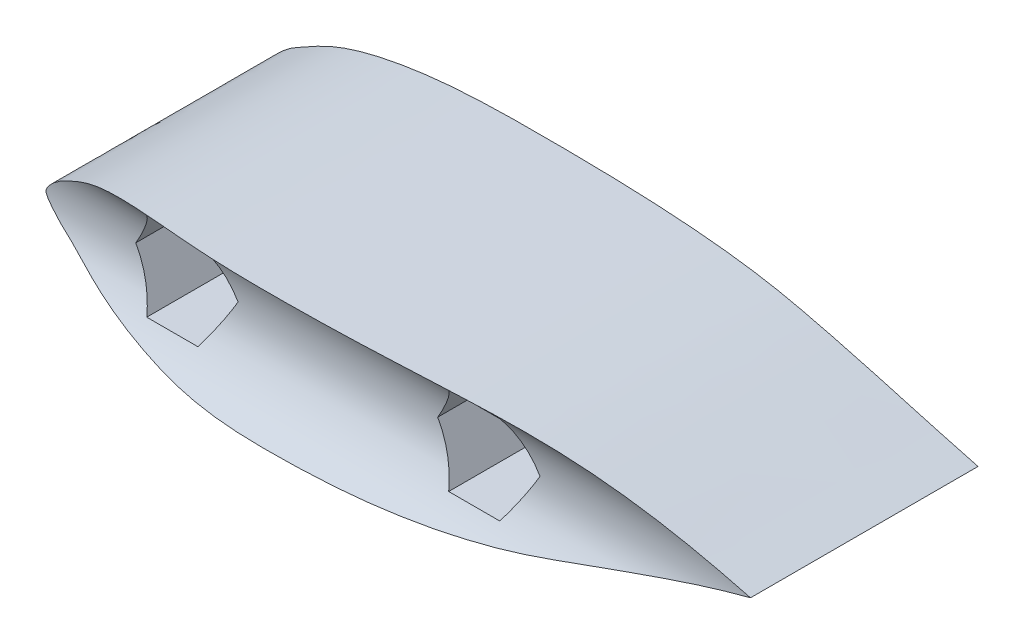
ISO-10303-21;
HEADER;
FILE_DESCRIPTION(('STEP AP214'),'2;1');
FILE_NAME('part.step','',(''),(''),'','','');
FILE_SCHEMA(('AUTOMOTIVE_DESIGN { 1 0 10303 214 1 1 1 1 }'));
ENDSEC;
DATA;
#1=APPLICATION_CONTEXT('core data for automotive mechanical design processes');
#2=APPLICATION_PROTOCOL_DEFINITION('international standard','automotive_design',2000,#1);
#3=PRODUCT_CONTEXT('',#1,'mechanical');
#4=PRODUCT('Part','Part','',(#3));
#5=PRODUCT_RELATED_PRODUCT_CATEGORY('part','',(#4));
#6=PRODUCT_DEFINITION_FORMATION('','',#4);
#7=PRODUCT_DEFINITION_CONTEXT('part definition',#1,'design');
#8=PRODUCT_DEFINITION('design','',#6,#7);
#9=PRODUCT_DEFINITION_SHAPE('','',#8);
#10=(LENGTH_UNIT() NAMED_UNIT(*) SI_UNIT(.MILLI.,.METRE.));
#11=(NAMED_UNIT(*) PLANE_ANGLE_UNIT() SI_UNIT($,.RADIAN.));
#12=(NAMED_UNIT(*) SI_UNIT($,.STERADIAN.) SOLID_ANGLE_UNIT());
#13=UNCERTAINTY_MEASURE_WITH_UNIT(LENGTH_MEASURE(1.E-05),#10,'distance_accuracy_value','');
#14=(GEOMETRIC_REPRESENTATION_CONTEXT(3) GLOBAL_UNCERTAINTY_ASSIGNED_CONTEXT((#13)) GLOBAL_UNIT_ASSIGNED_CONTEXT((#10,
#11,#12)) REPRESENTATION_CONTEXT('',''));
#15=CARTESIAN_POINT('',(0.,0.,0.));
#16=DIRECTION('',(0.,0.,1.));
#17=DIRECTION('',(1.,0.,0.));
#18=AXIS2_PLACEMENT_3D('',#15,#16,#17);
#19=CARTESIAN_POINT('',(0.,0.,15.));
#20=CARTESIAN_POINT('',(0.00772713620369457,-0.267032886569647,15.));
#21=CARTESIAN_POINT('',(0.79724552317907,-0.898720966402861,15.));
#22=CARTESIAN_POINT('',(1.40995747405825,-1.2361498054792,15.));
#23=CARTESIAN_POINT('',(3.06998534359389,-2.25920057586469,15.));
#24=CARTESIAN_POINT('',(7.56542515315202,-3.331084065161,15.));
#25=CARTESIAN_POINT('',(13.3623850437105,-3.48289192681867,15.));
#26=CARTESIAN_POINT('',(22.2900394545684,-3.26527474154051,15.));
#27=CARTESIAN_POINT('',(29.2938291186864,-1.65212955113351,15.));
#28=CARTESIAN_POINT('',(32.2346092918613,-0.717869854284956,15.));
#29=CARTESIAN_POINT('',(35.,0.,15.));
#30=B_SPLINE_CURVE_WITH_KNOTS('',3,(#19,#20,#21,#22,#23,#24,#25,#26,#27,#28,#29),.UNSPECIFIED.,
.F.,.F.,(4,1,1,1,1,1,1,1,4),(0.,0.0225244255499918,0.0346430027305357,0.121185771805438,
0.243771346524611,0.472972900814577,0.711145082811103,0.763847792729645,1.),.UNSPECIFIED.);
#31=DIRECTION('',(0.,0.,-1.));
#32=VECTOR('',#31,1.);
#33=SURFACE_OF_LINEAR_EXTRUSION('',#30,#32);
#34=CARTESIAN_POINT('',(0.,0.,11.3));
#35=CARTESIAN_POINT('',(0.000269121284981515,-0.00919435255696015,11.2999996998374));
#36=CARTESIAN_POINT('',(0.0011245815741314,-0.0183469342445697,11.300034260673));
#37=CARTESIAN_POINT('',(0.00380603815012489,-0.0364728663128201,11.3001687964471));
#38=CARTESIAN_POINT('',(0.00562799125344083,-0.0454468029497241,11.3002684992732));
#39=CARTESIAN_POINT('',(0.0121767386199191,-0.071758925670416,11.3006547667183));
#40=CARTESIAN_POINT('',(0.0180102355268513,-0.0888144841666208,11.3010288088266));
#41=CARTESIAN_POINT('',(0.0327249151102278,-0.124780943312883,11.3020539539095));
#42=CARTESIAN_POINT('',(0.0419470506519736,-0.143543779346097,11.3027401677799));
#43=CARTESIAN_POINT('',(0.06210611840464,-0.180123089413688,11.3043416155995));
#44=CARTESIAN_POINT('',(0.0730453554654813,-0.197938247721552,11.3052571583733));
#45=CARTESIAN_POINT('',(0.0963062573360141,-0.233067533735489,11.3073052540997));
#46=CARTESIAN_POINT('',(0.108648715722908,-0.250367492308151,11.3084413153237));
#47=CARTESIAN_POINT('',(0.134212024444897,-0.284265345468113,11.3108969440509));
#48=CARTESIAN_POINT('',(0.147432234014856,-0.300863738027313,11.312216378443));
#49=CARTESIAN_POINT('',(0.185370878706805,-0.346524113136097,11.31614460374));
#50=CARTESIAN_POINT('',(0.210836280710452,-0.374947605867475,11.3189412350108));
#51=CARTESIAN_POINT('',(0.26319371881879,-0.430405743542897,11.3250132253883));
#52=CARTESIAN_POINT('',(0.290086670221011,-0.457439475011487,11.3282888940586));
#53=CARTESIAN_POINT('',(0.344953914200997,-0.510444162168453,11.335281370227));
#54=CARTESIAN_POINT('',(0.372930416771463,-0.53641269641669,11.3389991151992));
#55=CARTESIAN_POINT('',(0.429653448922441,-0.587407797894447,11.3468346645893));
#56=CARTESIAN_POINT('',(0.458399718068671,-0.61243467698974,11.3509523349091));
#57=CARTESIAN_POINT('',(0.516386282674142,-0.66157388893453,11.3595413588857));
#58=CARTESIAN_POINT('',(0.545623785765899,-0.685689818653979,11.3640110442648));
#59=CARTESIAN_POINT('',(0.6046283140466,-0.733214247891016,11.3732958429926));
#60=CARTESIAN_POINT('',(0.634395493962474,-0.756622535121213,11.3781110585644));
#61=CARTESIAN_POINT('',(0.679375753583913,-0.791212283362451,11.3855675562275));
#62=CARTESIAN_POINT('',(0.694414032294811,-0.802647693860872,11.3880902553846));
#63=CARTESIAN_POINT('',(0.724607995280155,-0.825349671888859,11.3932100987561));
#64=CARTESIAN_POINT('',(0.739763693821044,-0.836616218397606,11.3958072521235));
#65=CARTESIAN_POINT('',(0.77018183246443,-0.858971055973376,11.4010695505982));
#66=CARTESIAN_POINT('',(0.785444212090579,-0.870059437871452,11.4037346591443));
#67=CARTESIAN_POINT('',(0.816105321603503,-0.892021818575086,11.409119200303));
#68=CARTESIAN_POINT('',(0.831504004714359,-0.902895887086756,11.4118386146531));
#69=CARTESIAN_POINT('',(0.866722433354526,-0.927287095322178,11.4180540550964));
#70=CARTESIAN_POINT('',(0.886602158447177,-0.940715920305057,11.4215595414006));
#71=CARTESIAN_POINT('',(0.926833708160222,-0.966856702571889,11.4285336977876));
#72=CARTESIAN_POINT('',(0.947185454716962,-0.979568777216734,11.4320023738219));
#73=CARTESIAN_POINT('',(0.978118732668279,-0.997992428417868,11.4371286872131));
#74=CARTESIAN_POINT('',(0.988501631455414,-1.00402850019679,11.438825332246));
#75=CARTESIAN_POINT('',(1.0093559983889,-1.01594956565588,11.4422078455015));
#76=CARTESIAN_POINT('',(1.01982747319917,-1.02183454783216,11.4438937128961));
#77=CARTESIAN_POINT('',(1.04076635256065,-1.03360606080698,11.4472973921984));
#78=CARTESIAN_POINT('',(1.05123375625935,-1.0394925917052,11.4490152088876));
#79=CARTESIAN_POINT('',(1.07214622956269,-1.05129270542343,11.4524908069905));
#80=CARTESIAN_POINT('',(1.08259129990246,-1.05720628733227,11.454248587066));
#81=CARTESIAN_POINT('',(1.11392231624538,-1.07498174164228,11.4595808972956));
#82=CARTESIAN_POINT('',(1.13478511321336,-1.08686765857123,11.4632113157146));
#83=CARTESIAN_POINT('',(1.17645976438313,-1.11068151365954,11.4706173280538));
#84=CARTESIAN_POINT('',(1.19727162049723,-1.12260945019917,11.4743929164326));
#85=CARTESIAN_POINT('',(1.23885072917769,-1.14647980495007,11.4820828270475));
#86=CARTESIAN_POINT('',(1.25961799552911,-1.15842221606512,11.4859970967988));
#87=CARTESIAN_POINT('',(1.30112591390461,-1.18230820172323,11.4939615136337));
#88=CARTESIAN_POINT('',(1.32186656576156,-1.19425177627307,11.4980116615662));
#89=CARTESIAN_POINT('',(1.38419690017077,-1.23013760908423,11.5103864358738));
#90=CARTESIAN_POINT('',(1.42576018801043,-1.25405731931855,11.5189103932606));
#91=CARTESIAN_POINT('',(1.50887778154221,-1.30173845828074,11.5364580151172));
#92=CARTESIAN_POINT('',(1.55043208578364,-1.32549986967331,11.5454817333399));
#93=CARTESIAN_POINT('',(1.67509563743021,-1.39639554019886,11.5732447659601));
#94=CARTESIAN_POINT('',(1.75825488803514,-1.44316992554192,11.5926858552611));
#95=CARTESIAN_POINT('',(1.92504944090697,-1.53532960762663,11.6332060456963));
#96=CARTESIAN_POINT('',(2.00868511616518,-1.58071356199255,11.6542866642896));
#97=CARTESIAN_POINT('',(2.17657458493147,-1.669702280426,11.697796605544));
#98=CARTESIAN_POINT('',(2.26082850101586,-1.71330667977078,11.7202262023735));
#99=CARTESIAN_POINT('',(2.43059195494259,-1.79865256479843,11.7662384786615));
#100=CARTESIAN_POINT('',(2.51610588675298,-1.84038221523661,11.7898269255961));
#101=CARTESIAN_POINT('',(2.68807891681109,-1.92142306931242,11.8376679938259));
#102=CARTESIAN_POINT('',(2.77453790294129,-1.96073455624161,11.8619205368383));
#103=CARTESIAN_POINT('',(2.94839424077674,-2.03650436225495,11.9105533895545));
#104=CARTESIAN_POINT('',(3.03578877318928,-2.07296943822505,11.9349332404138));
#105=CARTESIAN_POINT('',(3.21159490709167,-2.14334252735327,11.9837253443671));
#106=CARTESIAN_POINT('',(3.30000657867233,-2.17725036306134,12.0081375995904));
#107=CARTESIAN_POINT('',(3.5664160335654,-2.27545346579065,12.0812696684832));
#108=CARTESIAN_POINT('',(3.74571513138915,-2.33628277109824,12.129920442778));
#109=CARTESIAN_POINT('',(4.14484890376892,-2.46211609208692,12.2366424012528));
#110=CARTESIAN_POINT('',(4.36529101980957,-2.52531549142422,12.2945470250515));
#111=CARTESIAN_POINT('',(4.80940263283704,-2.64243502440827,12.4088168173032));
#112=CARTESIAN_POINT('',(5.03307683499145,-2.69633975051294,12.4651793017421));
#113=CARTESIAN_POINT('',(5.48279634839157,-2.79632290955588,12.5759239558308));
#114=CARTESIAN_POINT('',(5.70884305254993,-2.84239643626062,12.6303048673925));
#115=CARTESIAN_POINT('',(6.04897139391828,-2.90646282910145,12.7101029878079));
#116=CARTESIAN_POINT('',(6.16239036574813,-2.92695657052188,12.7363770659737));
#117=CARTESIAN_POINT('',(6.38962234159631,-2.96642755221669,12.7883549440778));
#118=CARTESIAN_POINT('',(6.5034353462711,-2.98540478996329,12.8140587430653));
#119=CARTESIAN_POINT('',(6.84525961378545,-3.04011871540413,12.8901257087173));
#120=CARTESIAN_POINT('',(7.07384843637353,-3.07367355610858,12.9394897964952));
#121=CARTESIAN_POINT('',(7.53259760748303,-3.13503186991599,13.0341002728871));
#122=CARTESIAN_POINT('',(7.7627575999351,-3.16283660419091,13.0793475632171));
#123=CARTESIAN_POINT('',(8.16760659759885,-3.2068080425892,13.1539860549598));
#124=CARTESIAN_POINT('',(8.34195535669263,-3.22415301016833,13.1845332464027));
#125=CARTESIAN_POINT('',(8.69151453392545,-3.25594023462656,13.2421781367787));
#126=CARTESIAN_POINT('',(8.86672507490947,-3.2703820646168,13.2692753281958));
#127=CARTESIAN_POINT('',(9.2178687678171,-3.29657905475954,13.3197099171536));
#128=CARTESIAN_POINT('',(9.39380184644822,-3.3083344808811,13.3430476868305));
#129=CARTESIAN_POINT('',(9.74623527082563,-3.32940883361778,13.3858112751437));
#130=CARTESIAN_POINT('',(9.92273543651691,-3.33872846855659,13.4052382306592));
#131=CARTESIAN_POINT('',(10.2762240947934,-3.35520565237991,13.4402022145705));
#132=CARTESIAN_POINT('',(10.4532125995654,-3.36236314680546,13.4557391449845));
#133=CARTESIAN_POINT('',(10.8075635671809,-3.37479207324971,13.4830944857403));
#134=CARTESIAN_POINT('',(10.9849260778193,-3.38006324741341,13.494912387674));
#135=CARTESIAN_POINT('',(11.4301378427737,-3.39126104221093,13.5202585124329));
#136=CARTESIAN_POINT('',(11.6981376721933,-3.39615793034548,13.5316005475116));
#137=CARTESIAN_POINT('',(12.2343775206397,-3.40314750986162,13.54787800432));
#138=CARTESIAN_POINT('',(12.5026175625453,-3.4052398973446,13.5528127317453));
#139=CARTESIAN_POINT('',(13.0393530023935,-3.40737952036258,13.5578592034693));
#140=CARTESIAN_POINT('',(13.3078484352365,-3.4074251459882,13.5579671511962));
#141=CARTESIAN_POINT('',(13.7105645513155,-3.4064216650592,13.5556000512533));
#142=CARTESIAN_POINT('',(13.8447976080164,-3.40590852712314,13.5543895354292));
#143=CARTESIAN_POINT('',(14.1132551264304,-3.40460044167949,13.5513113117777));
#144=CARTESIAN_POINT('',(14.2474795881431,-3.40380549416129,13.5494436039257));
#145=CARTESIAN_POINT('',(14.5160226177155,-3.4019170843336,13.5450202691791));
#146=CARTESIAN_POINT('',(14.6503411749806,-3.40082338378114,13.5424640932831));
#147=CARTESIAN_POINT('',(14.9189573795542,-3.39828943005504,13.5365660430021));
#148=CARTESIAN_POINT('',(15.0532550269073,-3.39684917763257,13.5332241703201));
#149=CARTESIAN_POINT('',(15.456101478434,-3.39195292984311,13.5219184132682));
#150=CARTESIAN_POINT('',(15.7246094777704,-3.38792140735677,13.5126743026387));
#151=CARTESIAN_POINT('',(16.2615200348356,-3.37803257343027,13.4903494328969));
#152=CARTESIAN_POINT('',(16.5299225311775,-3.37217467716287,13.4772674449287));
#153=CARTESIAN_POINT('',(17.066447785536,-3.35835703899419,13.4470305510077));
#154=CARTESIAN_POINT('',(17.3345705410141,-3.35039727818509,13.4298756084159));
#155=CARTESIAN_POINT('',(17.8724981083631,-3.33202499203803,13.3912515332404));
#156=CARTESIAN_POINT('',(18.142299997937,-3.32159407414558,13.3697502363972));
#157=CARTESIAN_POINT('',(18.6814141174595,-3.29800713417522,13.3225496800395));
#158=CARTESIAN_POINT('',(18.9507263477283,-3.28485111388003,13.2968504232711));
#159=CARTESIAN_POINT('',(19.7572953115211,-3.24083555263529,13.2136747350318));
#160=CARTESIAN_POINT('',(20.2936924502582,-3.20541236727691,13.1500835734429));
#161=CARTESIAN_POINT('',(21.3627551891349,-3.11928790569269,13.0082805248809));
#162=CARTESIAN_POINT('',(21.8954242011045,-3.06860321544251,12.9300845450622));
#163=CARTESIAN_POINT('',(22.690985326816,-2.97779135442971,12.8033146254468));
#164=CARTESIAN_POINT('',(22.9554964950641,-2.94507218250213,12.7594975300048));
#165=CARTESIAN_POINT('',(23.4832525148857,-2.87394393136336,12.6689544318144));
#166=CARTESIAN_POINT('',(23.7464974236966,-2.83553511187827,12.6222285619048));
#167=CARTESIAN_POINT('',(24.1636919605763,-2.76923112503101,12.5458686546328));
#168=CARTESIAN_POINT('',(24.3181433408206,-2.74349326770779,12.5170931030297));
#169=CARTESIAN_POINT('',(24.5493655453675,-2.70298874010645,12.4732932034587));
#170=CARTESIAN_POINT('',(24.6263632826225,-2.68917104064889,12.4585872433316));
#171=CARTESIAN_POINT('',(24.7801963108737,-2.66086830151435,12.4289692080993));
#172=CARTESIAN_POINT('',(24.8570316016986,-2.64638326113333,12.4140571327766));
#173=CARTESIAN_POINT('',(25.0873739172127,-2.60196611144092,12.3691172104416));
#174=CARTESIAN_POINT('',(25.2406602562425,-2.57108200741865,12.3388965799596));
#175=CARTESIAN_POINT('',(25.5467840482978,-2.50709554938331,12.2785285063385));
#176=CARTESIAN_POINT('',(25.6996214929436,-2.47399315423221,12.2483810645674));
#177=CARTESIAN_POINT('',(26.0050785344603,-2.40591059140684,12.1886575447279));
#178=CARTESIAN_POINT('',(26.1576979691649,-2.37092941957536,12.1590817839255));
#179=CARTESIAN_POINT('',(26.4627885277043,-2.29950043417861,12.1009630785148));
#180=CARTESIAN_POINT('',(26.6152596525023,-2.26305263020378,12.0724201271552));
#181=CARTESIAN_POINT('',(26.9202890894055,-2.18916614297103,12.0167636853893));
#182=CARTESIAN_POINT('',(27.0728474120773,-2.15172707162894,11.9896507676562));
#183=CARTESIAN_POINT('',(27.3779967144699,-2.07595227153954,11.9369047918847));
#184=CARTESIAN_POINT('',(27.53058769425,-2.03761654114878,11.9112717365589));
#185=CARTESIAN_POINT('',(27.9884820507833,-1.92128375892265,11.8365900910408));
#186=CARTESIAN_POINT('',(28.2938221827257,-1.84198166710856,11.7897744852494));
#187=CARTESIAN_POINT('',(28.9046537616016,-1.68036556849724,11.7023018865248));
#188=CARTESIAN_POINT('',(29.2101452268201,-1.59805093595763,11.661646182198));
#189=CARTESIAN_POINT('',(29.818883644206,-1.43175555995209,11.5870374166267));
#190=CARTESIAN_POINT('',(30.1221294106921,-1.34779294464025,11.5530342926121));
#191=CARTESIAN_POINT('',(30.7289141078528,-1.17841903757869,11.4915179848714));
#192=CARTESIAN_POINT('',(31.0324530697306,-1.09300757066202,11.4640055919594));
#193=CARTESIAN_POINT('',(31.6400312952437,-0.92170118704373,11.415534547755));
#194=CARTESIAN_POINT('',(31.9440706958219,-0.835806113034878,11.3945781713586));
#195=CARTESIAN_POINT('',(32.5528638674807,-0.664558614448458,11.3591189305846));
#196=CARTESIAN_POINT('',(32.8576179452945,-0.579206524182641,11.3446197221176));
#197=CARTESIAN_POINT('',(33.4680397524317,-0.410058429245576,11.3218030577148));
#198=CARTESIAN_POINT('',(33.7737080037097,-0.326263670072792,11.3134903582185));
#199=CARTESIAN_POINT('',(34.3861057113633,-0.16108445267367,11.3025749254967));
#200=CARTESIAN_POINT('',(34.6928358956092,-0.0797023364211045,11.2999775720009));
#201=CARTESIAN_POINT('',(35.,0.,11.3));
#202=B_SPLINE_CURVE_WITH_KNOTS('',3,(#34,#35,#36,#37,#38,#39,#40,#41,#42,#43,#44,#45,#46,#47,
#48,#49,#50,#51,#52,#53,#54,#55,#56,#57,#58,#59,#60,#61,#62,#63,#64,#65,#66,#67,#68,#69,#70,#71,
#72,#73,#74,#75,#76,#77,#78,#79,#80,#81,#82,#83,#84,#85,#86,#87,#88,#89,#90,#91,#92,#93,#94,#95,
#96,#97,#98,#99,#100,#101,#102,#103,#104,#105,#106,#107,#108,#109,#110,#111,#112,#113,#114,#115,
#116,#117,#118,#119,#120,#121,#122,#123,#124,#125,#126,#127,#128,#129,#130,#131,#132,#133,#134,
#135,#136,#137,#138,#139,#140,#141,#142,#143,#144,#145,#146,#147,#148,#149,#150,#151,#152,#153,
#154,#155,#156,#157,#158,#159,#160,#161,#162,#163,#164,#165,#166,#167,#168,#169,#170,#171,#172,
#173,#174,#175,#176,#177,#178,#179,#180,#181,#182,#183,#184,#185,#186,#187,#188,#189,#190,#191,
#192,#193,#194,#195,#196,#197,#198,#199,#200,#201),.UNSPECIFIED.,.F.,.F.,(4,2,2,2,2,2,2,2,2,2,2,
2,2,2,2,2,2,2,2,2,2,2,2,2,2,2,2,2,2,2,2,2,2,2,2,2,2,2,2,2,2,2,2,2,2,2,2,2,2,2,2,2,2,2,2,2,2,2,2,
2,2,2,2,2,2,2,2,2,2,2,2,2,2,2,2,2,2,2,2,2,2,2,2,4),(0.,0.0275397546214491,0.0549651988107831,
0.108848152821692,0.171475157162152,0.234186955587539,0.29799315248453,0.36175327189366,
0.47645984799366,0.591240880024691,0.706269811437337,0.821260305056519,0.935735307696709,
1.05024431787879,1.10742322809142,1.1646091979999,1.22176502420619,1.27890194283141,
1.3516275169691,1.42434114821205,1.46072682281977,1.49711525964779,1.5335091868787,
1.56990189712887,1.64275321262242,1.71560175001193,1.78842300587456,1.86124471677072,
2.00736073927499,2.15349250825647,2.44558224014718,2.73794560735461,3.03036859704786,
3.32443356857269,3.61846402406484,3.91177381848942,4.20510394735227,4.79133696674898,
5.50064416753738,6.21111609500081,6.92203150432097,7.27665906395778,7.63128721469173,
8.33994125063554,9.04843969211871,9.58194207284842,10.1155228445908,10.6490507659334,
11.1824233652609,11.7158093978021,12.2492683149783,13.0539964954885,13.8588118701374,
14.6642602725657,15.0669776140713,15.4696949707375,15.8727344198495,16.2757729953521,
17.0818330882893,17.8881515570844,18.6944772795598,19.5070041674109,20.3195305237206,
21.943055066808,23.5648215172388,24.3750751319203,25.1852917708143,25.6628803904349,
25.9016714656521,26.140462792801,26.6182224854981,27.0959910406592,27.5740175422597,
28.0520409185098,28.5302542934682,29.0084685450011,29.9651624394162,30.9220561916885,
31.8714458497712,32.8209511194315,33.7707854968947,34.7211569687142,35.6722583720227,
36.624254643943),.UNSPECIFIED.);
#203=CARTESIAN_POINT('',(0.,0.,11.3));
#204=VERTEX_POINT('',#203);
#205=CARTESIAN_POINT('',(35.,0.,11.3));
#206=VERTEX_POINT('',#205);
#207=EDGE_CURVE('E191',#204,#206,#202,.T.);
#208=ORIENTED_EDGE('',*,*,#207,.F.);
#209=DIRECTION('',(0.,0.,-1.));
#210=VECTOR('',#209,1.);
#211=CARTESIAN_POINT('',(0.,0.,15.));
#212=LINE('',#211,#210);
#213=CARTESIAN_POINT('',(0.,0.,0.));
#214=VERTEX_POINT('',#213);
#215=EDGE_CURVE('E305',#204,#214,#212,.T.);
#216=ORIENTED_EDGE('',*,*,#215,.T.);
#217=CARTESIAN_POINT('',(0.,0.,0.));
#218=CARTESIAN_POINT('',(0.00772713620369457,-0.267032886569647,0.));
#219=CARTESIAN_POINT('',(0.79724552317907,-0.898720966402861,0.));
#220=CARTESIAN_POINT('',(1.40995747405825,-1.2361498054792,0.));
#221=CARTESIAN_POINT('',(3.06998534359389,-2.25920057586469,0.));
#222=CARTESIAN_POINT('',(7.56542515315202,-3.331084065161,0.));
#223=CARTESIAN_POINT('',(13.3623850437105,-3.48289192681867,0.));
#224=CARTESIAN_POINT('',(22.2900394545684,-3.26527474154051,0.));
#225=CARTESIAN_POINT('',(29.2938291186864,-1.65212955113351,0.));
#226=CARTESIAN_POINT('',(32.2346092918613,-0.717869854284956,0.));
#227=CARTESIAN_POINT('',(35.,0.,0.));
#228=B_SPLINE_CURVE_WITH_KNOTS('',3,(#217,#218,#219,#220,#221,#222,#223,#224,#225,#226,#227),
.UNSPECIFIED.,.F.,.F.,(4,1,1,1,1,1,1,1,4),(0.,0.0225244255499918,0.0346430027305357,
0.121185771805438,0.243771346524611,0.472972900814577,0.711145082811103,0.763847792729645,1.),.UNSPECIFIED.);
#229=CARTESIAN_POINT('',(35.,0.,0.));
#230=VERTEX_POINT('',#229);
#231=EDGE_CURVE('E253',#214,#230,#228,.T.);
#232=ORIENTED_EDGE('',*,*,#231,.T.);
#233=DIRECTION('',(0.,0.,-1.));
#234=VECTOR('',#233,1.);
#235=CARTESIAN_POINT('',(35.,0.,15.));
#236=LINE('',#235,#234);
#237=EDGE_CURVE('E278',#206,#230,#236,.T.);
#238=ORIENTED_EDGE('',*,*,#237,.F.);
#239=EDGE_LOOP('',(#208,#216,#232,#238));
#240=FACE_BOUND('',#239,.T.);
#241=ADVANCED_FACE('F39',(#240),#33,.F.);
#242=CARTESIAN_POINT('',(35.,0.,15.));
#243=CARTESIAN_POINT('',(32.2346092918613,0.717869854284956,15.));
#244=CARTESIAN_POINT('',(29.2938291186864,1.65212955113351,15.));
#245=CARTESIAN_POINT('',(22.2900394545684,3.26527474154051,15.));
#246=CARTESIAN_POINT('',(13.3623850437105,3.48289192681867,15.));
#247=CARTESIAN_POINT('',(7.56542515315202,3.331084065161,15.));
#248=CARTESIAN_POINT('',(3.06998534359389,2.25920057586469,15.));
#249=CARTESIAN_POINT('',(1.40995747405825,1.2361498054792,15.));
#250=CARTESIAN_POINT('',(0.79724552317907,0.898720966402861,15.));
#251=CARTESIAN_POINT('',(0.00772713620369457,0.267032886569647,15.));
#252=CARTESIAN_POINT('',(0.,0.,15.));
#253=B_SPLINE_CURVE_WITH_KNOTS('',3,(#242,#243,#244,#245,#246,#247,#248,#249,#250,#251,#252),
.UNSPECIFIED.,.F.,.F.,(4,1,1,1,1,1,1,1,4),(0.,0.236152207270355,0.288854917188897,
0.527027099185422,0.756228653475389,0.878814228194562,0.965356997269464,0.977475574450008,1.),.UNSPECIFIED.);
#254=DIRECTION('',(0.,0.,-1.));
#255=VECTOR('',#254,1.);
#256=SURFACE_OF_LINEAR_EXTRUSION('',#253,#255);
#257=CARTESIAN_POINT('',(35.,0.,11.3));
#258=CARTESIAN_POINT('',(34.7599453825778,0.0623024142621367,11.2999923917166));
#259=CARTESIAN_POINT('',(34.520152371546,0.125616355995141,11.3015734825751));
#260=CARTESIAN_POINT('',(34.0410989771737,0.253863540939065,11.308162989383));
#261=CARTESIAN_POINT('',(33.8018384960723,0.31879645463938,11.313170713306));
#262=CARTESIAN_POINT('',(33.3238016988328,0.449892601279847,11.326862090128));
#263=CARTESIAN_POINT('',(33.0850253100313,0.516055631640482,11.3355451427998));
#264=CARTESIAN_POINT('',(32.6078867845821,0.649149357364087,11.3567673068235));
#265=CARTESIAN_POINT('',(32.36952460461,0.716079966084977,11.3693059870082));
#266=CARTESIAN_POINT('',(31.8931341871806,0.850218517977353,11.3983562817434));
#267=CARTESIAN_POINT('',(31.6551059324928,0.9174264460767,11.4148676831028));
#268=CARTESIAN_POINT('',(31.1798300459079,1.05147147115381,11.4518693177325));
#269=CARTESIAN_POINT('',(30.9425818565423,1.11830906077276,11.4723506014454));
#270=CARTESIAN_POINT('',(30.4682638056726,1.25128668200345,11.5172987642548));
#271=CARTESIAN_POINT('',(30.2311939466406,1.31742670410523,11.5417656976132));
#272=CARTESIAN_POINT('',(29.7571610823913,1.44857862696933,11.5946190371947));
#273=CARTESIAN_POINT('',(29.5201980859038,1.51359044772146,11.6230057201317));
#274=CARTESIAN_POINT('',(29.0463182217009,1.64211661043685,11.6836010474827));
#275=CARTESIAN_POINT('',(28.8094013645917,1.70563074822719,11.7158102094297));
#276=CARTESIAN_POINT('',(28.4540458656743,1.79955191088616,11.7669079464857));
#277=CARTESIAN_POINT('',(28.3355848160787,1.83063717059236,11.7844065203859));
#278=CARTESIAN_POINT('',(28.0986752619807,1.89232561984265,11.8203180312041));
#279=CARTESIAN_POINT('',(27.9802267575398,1.92292880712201,11.838730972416));
#280=CARTESIAN_POINT('',(27.6419613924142,2.009603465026,11.8926068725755));
#281=CARTESIAN_POINT('',(27.4221591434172,2.06505320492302,11.9291736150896));
#282=CARTESIAN_POINT('',(27.0925004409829,2.1468073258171,11.9863104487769));
#283=CARTESIAN_POINT('',(26.9826200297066,2.17382233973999,12.0057374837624));
#284=CARTESIAN_POINT('',(26.7628819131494,2.22737802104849,12.0453604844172));
#285=CARTESIAN_POINT('',(26.6530242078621,2.25391868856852,12.0655564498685));
#286=CARTESIAN_POINT('',(26.4332318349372,2.30637531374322,12.1066035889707));
#287=CARTESIAN_POINT('',(26.3232971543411,2.33229100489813,12.1274550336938));
#288=CARTESIAN_POINT('',(26.1033347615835,2.38331723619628,12.1696475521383));
#289=CARTESIAN_POINT('',(25.9933070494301,2.40842777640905,12.1909886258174));
#290=CARTESIAN_POINT('',(25.7731041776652,2.45769494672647,12.2339912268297));
#291=CARTESIAN_POINT('',(25.6629290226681,2.48185160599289,12.2556527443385));
#292=CARTESIAN_POINT('',(25.4423704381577,2.52907290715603,12.2991075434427));
#293=CARTESIAN_POINT('',(25.3319870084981,2.55213754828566,12.3209008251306));
#294=CARTESIAN_POINT('',(25.1110352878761,2.59703881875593,12.3644041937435));
#295=CARTESIAN_POINT('',(25.0004671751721,2.61887627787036,12.3861143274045));
#296=CARTESIAN_POINT('',(24.779012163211,2.66120333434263,12.4292198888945));
#297=CARTESIAN_POINT('',(24.6681252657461,2.6816929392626,12.4506153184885));
#298=CARTESIAN_POINT('',(24.4460216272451,2.72131565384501,12.492953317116));
#299=CARTESIAN_POINT('',(24.3348048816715,2.74044874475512,12.5138958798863));
#300=CARTESIAN_POINT('',(24.112079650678,2.7774694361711,12.5553253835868));
#301=CARTESIAN_POINT('',(24.0005711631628,2.7953570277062,12.5758123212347));
#302=CARTESIAN_POINT('',(23.6657420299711,2.84725217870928,12.6365291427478));
#303=CARTESIAN_POINT('',(23.4420165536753,2.87950999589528,12.6760343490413));
#304=CARTESIAN_POINT('',(22.9936545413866,2.93992090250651,12.7529456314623));
#305=CARTESIAN_POINT('',(22.7690179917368,2.96807393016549,12.7903516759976));
#306=CARTESIAN_POINT('',(22.3190375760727,3.02072464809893,12.8628918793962));
#307=CARTESIAN_POINT('',(22.0936940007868,3.04522367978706,12.898026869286));
#308=CARTESIAN_POINT('',(21.6423204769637,3.09096339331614,12.9658870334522));
#309=CARTESIAN_POINT('',(21.4162905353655,3.11220410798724,12.9986122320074));
#310=CARTESIAN_POINT('',(20.738413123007,3.17144720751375,13.0927923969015));
#311=CARTESIAN_POINT('',(20.2856444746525,3.20509953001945,13.1504360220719));
#312=CARTESIAN_POINT('',(19.3777416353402,3.26294106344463,13.2545047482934));
#313=CARTESIAN_POINT('',(18.9226054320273,3.28712011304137,13.300917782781));
#314=CARTESIAN_POINT('',(18.0104690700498,3.32765883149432,13.3817490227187));
#315=CARTESIAN_POINT('',(17.5534675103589,3.34401072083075,13.4161552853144));
#316=CARTESIAN_POINT('',(16.6381744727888,3.37031029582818,13.4729134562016));
#317=CARTESIAN_POINT('',(16.1798822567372,3.38025286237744,13.495255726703));
#318=CARTESIAN_POINT('',(15.4920302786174,3.39138747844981,13.5206202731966));
#319=CARTESIAN_POINT('',(15.2626378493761,3.39446934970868,13.527717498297));
#320=CARTESIAN_POINT('',(14.8037770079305,3.39954892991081,13.5394825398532));
#321=CARTESIAN_POINT('',(14.5743085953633,3.40154663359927,13.5441503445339));
#322=CARTESIAN_POINT('',(14.1943259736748,3.40414640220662,13.5502438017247));
#323=CARTESIAN_POINT('',(14.0438216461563,3.40499217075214,13.5522323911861));
#324=CARTESIAN_POINT('',(13.7428027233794,3.40631534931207,13.5553482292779));
#325=CARTESIAN_POINT('',(13.5922881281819,3.40679276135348,13.5564754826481));
#326=CARTESIAN_POINT('',(13.2913690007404,3.40726492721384,13.5575900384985));
#327=CARTESIAN_POINT('',(13.140964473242,3.40726005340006,13.5575782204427));
#328=CARTESIAN_POINT('',(12.8401637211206,3.40666256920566,13.5561684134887));
#329=CARTESIAN_POINT('',(12.6897674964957,3.4060699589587,13.5547704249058));
#330=CARTESIAN_POINT('',(12.238856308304,3.40323087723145,13.5480865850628));
#331=CARTESIAN_POINT('',(11.9383743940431,3.39992391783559,13.540312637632));
#332=CARTESIAN_POINT('',(11.3378916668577,3.38936444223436,13.5159544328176));
#333=CARTESIAN_POINT('',(11.0378907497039,3.38211294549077,13.4993724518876));
#334=CARTESIAN_POINT('',(10.4393604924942,3.36240130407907,13.4557092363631));
#335=CARTESIAN_POINT('',(10.1408294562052,3.34995082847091,13.4286474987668));
#336=CARTESIAN_POINT('',(9.5451930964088,3.31850704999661,13.3632892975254));
#337=CARTESIAN_POINT('',(9.24808849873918,3.29951071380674,13.3249876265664));
#338=CARTESIAN_POINT('',(8.65602480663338,3.25374327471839,13.2377369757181));
#339=CARTESIAN_POINT('',(8.3610659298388,3.22697139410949,13.1887869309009));
#340=CARTESIAN_POINT('',(7.77379230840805,3.16469378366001,13.0820554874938));
#341=CARTESIAN_POINT('',(7.48147668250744,3.12919108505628,13.0242771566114));
#342=CARTESIAN_POINT('',(7.05068154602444,3.06974279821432,12.9341079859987));
#343=CARTESIAN_POINT('',(6.91118637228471,3.04937679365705,12.904124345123));
#344=CARTESIAN_POINT('',(6.63280178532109,3.00648710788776,12.8430516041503));
#345=CARTESIAN_POINT('',(6.4939122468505,2.98396389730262,12.8119627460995));
#346=CARTESIAN_POINT('',(6.21671281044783,2.93670940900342,12.7489351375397));
#347=CARTESIAN_POINT('',(6.07840287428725,2.91197827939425,12.7169964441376));
#348=CARTESIAN_POINT('',(5.80216785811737,2.86000253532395,12.6522112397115));
#349=CARTESIAN_POINT('',(5.6642440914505,2.83275301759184,12.6193630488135));
#350=CARTESIAN_POINT('',(5.38914276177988,2.77552000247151,12.5528762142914));
#351=CARTESIAN_POINT('',(5.2519652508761,2.74553631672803,12.5192375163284));
#352=CARTESIAN_POINT('',(4.97846188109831,2.68252283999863,12.451232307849));
#353=CARTESIAN_POINT('',(4.84213621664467,2.64949237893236,12.4168656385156));
#354=CARTESIAN_POINT('',(4.48817193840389,2.55899640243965,12.3264672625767));
#355=CARTESIAN_POINT('',(4.27132917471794,2.49885466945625,12.2699290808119));
#356=CARTESIAN_POINT('',(3.9487001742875,2.40074490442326,12.1842768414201));
#357=CARTESIAN_POINT('',(3.8415930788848,2.36672427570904,12.1555843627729));
#358=CARTESIAN_POINT('',(3.62839843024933,2.29576469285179,12.0980083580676));
#359=CARTESIAN_POINT('',(3.52231086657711,2.2588257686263,12.0691248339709));
#360=CARTESIAN_POINT('',(3.31131434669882,2.18170165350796,12.0112707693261));
#361=CARTESIAN_POINT('',(3.20640562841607,2.14151582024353,11.9823002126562));
#362=CARTESIAN_POINT('',(3.05011778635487,2.07853732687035,11.9389002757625));
#363=CARTESIAN_POINT('',(2.99820058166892,2.05709433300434,11.92444281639));
#364=CARTESIAN_POINT('',(2.89476634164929,2.01324297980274,11.8955608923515));
#365=CARTESIAN_POINT('',(2.84324930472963,1.99083462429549,11.8811364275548));
#366=CARTESIAN_POINT('',(2.68969189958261,1.92240026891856,11.8381546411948));
#367=CARTESIAN_POINT('',(2.58821701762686,1.8749922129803,11.8097689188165));
#368=CARTESIAN_POINT('',(2.38649310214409,1.77700274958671,11.7541660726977));
#369=CARTESIAN_POINT('',(2.28624408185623,1.72642130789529,11.72694896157));
#370=CARTESIAN_POINT('',(2.08663993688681,1.62254751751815,11.6742323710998));
#371=CARTESIAN_POINT('',(1.98728525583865,1.56925390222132,11.648733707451));
#372=CARTESIAN_POINT('',(1.83871946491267,1.48772935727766,11.612146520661));
#373=CARTESIAN_POINT('',(1.7892749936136,1.46029034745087,11.600227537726));
#374=CARTESIAN_POINT('',(1.69048951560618,1.404971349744,11.5769962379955));
#375=CARTESIAN_POINT('',(1.64114850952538,1.37709135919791,11.5656839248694));
#376=CARTESIAN_POINT('',(1.54256590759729,1.3210249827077,11.5437305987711));
#377=CARTESIAN_POINT('',(1.49332426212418,1.29283896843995,11.5330888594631));
#378=CARTESIAN_POINT('',(1.4194391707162,1.25040879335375,11.5176581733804));
#379=CARTESIAN_POINT('',(1.39480744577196,1.23624044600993,11.5126033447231));
#380=CARTESIAN_POINT('',(1.34552364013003,1.20787429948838,11.5026773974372));
#381=CARTESIAN_POINT('',(1.32087155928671,1.19367650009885,11.4978062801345));
#382=CARTESIAN_POINT('',(1.27153079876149,1.16527479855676,11.4882541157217));
#383=CARTESIAN_POINT('',(1.24684211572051,1.15107089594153,11.4835730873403));
#384=CARTESIAN_POINT('',(1.19741405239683,1.12268841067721,11.4744088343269));
#385=CARTESIAN_POINT('',(1.17267467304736,1.10850982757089,11.4699256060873));
#386=CARTESIAN_POINT('',(1.13551056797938,1.08728881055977,11.4633549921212));
#387=CARTESIAN_POINT('',(1.12311295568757,1.08022271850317,11.4611904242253));
#388=CARTESIAN_POINT('',(1.09829683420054,1.06611148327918,11.4569136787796));
#389=CARTESIAN_POINT('',(1.08587832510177,1.05906634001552,11.4548015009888));
#390=CARTESIAN_POINT('',(1.06101546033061,1.04500545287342,11.4506314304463));
#391=CARTESIAN_POINT('',(1.04857110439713,1.03798970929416,11.448573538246));
#392=CARTESIAN_POINT('',(1.02365767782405,1.02398668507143,11.4445105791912));
#393=CARTESIAN_POINT('',(1.01118860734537,1.01699940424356,11.442505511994));
#394=CARTESIAN_POINT('',(0.989197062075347,1.00442424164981,11.4389377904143));
#395=CARTESIAN_POINT('',(0.9796495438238,0.998879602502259,11.4373782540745));
#396=CARTESIAN_POINT('',(0.960663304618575,0.987614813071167,11.4342390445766));
#397=CARTESIAN_POINT('',(0.951224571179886,0.981894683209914,11.432659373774));
#398=CARTESIAN_POINT('',(0.932462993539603,0.970280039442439,11.4294828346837));
#399=CARTESIAN_POINT('',(0.92314010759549,0.964385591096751,11.4278859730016));
#400=CARTESIAN_POINT('',(0.904595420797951,0.952440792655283,11.4246825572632));
#401=CARTESIAN_POINT('',(0.895373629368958,0.94639042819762,11.4230760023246));
#402=CARTESIAN_POINT('',(0.867851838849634,0.928054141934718,11.4182581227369));
#403=CARTESIAN_POINT('',(0.849681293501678,0.915574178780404,11.4150461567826));
#404=CARTESIAN_POINT('',(0.81357438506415,0.890256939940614,11.4086752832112));
#405=CARTESIAN_POINT('',(0.795638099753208,0.877419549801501,11.4055163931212));
#406=CARTESIAN_POINT('',(0.75997633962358,0.851527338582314,11.3992947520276));
#407=CARTESIAN_POINT('',(0.742250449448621,0.838473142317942,11.3962317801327));
#408=CARTESIAN_POINT('',(0.706957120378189,0.812135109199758,11.3902051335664));
#409=CARTESIAN_POINT('',(0.689389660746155,0.798851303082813,11.3872414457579));
#410=CARTESIAN_POINT('',(0.636905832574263,0.758643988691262,11.3785068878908));
#411=CARTESIAN_POINT('',(0.602224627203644,0.731376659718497,11.3728954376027));
#412=CARTESIAN_POINT('',(0.543226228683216,0.683668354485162,11.363654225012));
#413=CARTESIAN_POINT('',(0.518735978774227,0.663462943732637,11.3599107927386));
#414=CARTESIAN_POINT('',(0.470188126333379,0.622500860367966,11.3526824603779));
#415=CARTESIAN_POINT('',(0.446130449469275,0.601744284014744,11.349197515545));
#416=CARTESIAN_POINT('',(0.398428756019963,0.559520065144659,11.3424876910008));
#417=CARTESIAN_POINT('',(0.374786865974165,0.538049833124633,11.3392639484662));
#418=CARTESIAN_POINT('',(0.328142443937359,0.494380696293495,11.3331111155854));
#419=CARTESIAN_POINT('',(0.305139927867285,0.472181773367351,11.3301820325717));
#420=CARTESIAN_POINT('',(0.259754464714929,0.426712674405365,11.3246162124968));
#421=CARTESIAN_POINT('',(0.237379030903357,0.403434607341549,11.3219823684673));
#422=CARTESIAN_POINT('',(0.193754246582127,0.355785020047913,11.3170675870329));
#423=CARTESIAN_POINT('',(0.172505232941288,0.331413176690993,11.3147867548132));
#424=CARTESIAN_POINT('',(0.131753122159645,0.281419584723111,11.3106328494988));
#425=CARTESIAN_POINT('',(0.112241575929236,0.255804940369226,11.3087577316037));
#426=CARTESIAN_POINT('',(0.0757001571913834,0.202727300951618,11.3054621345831));
#427=CARTESIAN_POINT('',(0.0586717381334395,0.175263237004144,11.3040419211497));
#428=CARTESIAN_POINT('',(0.0350188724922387,0.129366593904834,11.3022220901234));
#429=CARTESIAN_POINT('',(0.0269522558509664,0.111694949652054,11.3016412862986));
#430=CARTESIAN_POINT('',(0.0133529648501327,0.0754252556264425,11.3007248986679));
#431=CARTESIAN_POINT('',(0.00780651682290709,0.056832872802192,11.3003879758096));
#432=CARTESIAN_POINT('',(0.00305222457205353,0.031636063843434,11.3001299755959));
#433=CARTESIAN_POINT('',(0.00208878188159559,0.0253630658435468,11.3000815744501));
#434=CARTESIAN_POINT('',(0.000653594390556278,0.0127320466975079,11.3000164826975));
#435=CARTESIAN_POINT('',(0.000184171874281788,0.00637376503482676,11.2999999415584));
#436=CARTESIAN_POINT('',(0.,0.,11.2999999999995));
#437=B_SPLINE_CURVE_WITH_KNOTS('',3,(#257,#258,#259,#260,#261,#262,#263,#264,#265,#266,#267,
#268,#269,#270,#271,#272,#273,#274,#275,#276,#277,#278,#279,#280,#281,#282,#283,#284,#285,#286,
#287,#288,#289,#290,#291,#292,#293,#294,#295,#296,#297,#298,#299,#300,#301,#302,#303,#304,#305,
#306,#307,#308,#309,#310,#311,#312,#313,#314,#315,#316,#317,#318,#319,#320,#321,#322,#323,#324,
#325,#326,#327,#328,#329,#330,#331,#332,#333,#334,#335,#336,#337,#338,#339,#340,#341,#342,#343,
#344,#345,#346,#347,#348,#349,#350,#351,#352,#353,#354,#355,#356,#357,#358,#359,#360,#361,#362,
#363,#364,#365,#366,#367,#368,#369,#370,#371,#372,#373,#374,#375,#376,#377,#378,#379,#380,#381,
#382,#383,#384,#385,#386,#387,#388,#389,#390,#391,#392,#393,#394,#395,#396,#397,#398,#399,#400,
#401,#402,#403,#404,#405,#406,#407,#408,#409,#410,#411,#412,#413,#414,#415,#416,#417,#418,#419,
#420,#421,#422,#423,#424,#425,#426,#427,#428,#429,#430,#431,#432,#433,#434,#435,#436),
.UNSPECIFIED.,.F.,.F.,(4,2,2,2,2,2,2,2,2,2,2,2,2,2,2,2,2,2,2,2,2,2,2,2,2,2,2,2,2,2,2,2,2,2,2,2,
2,2,2,2,2,2,2,2,2,2,2,2,2,2,2,2,2,2,2,2,2,2,2,2,2,2,2,2,2,2,2,2,2,2,2,2,2,2,2,2,2,2,2,2,2,2,2,2,
2,2,2,2,2,4),(0.,0.744017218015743,1.48788422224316,2.23162979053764,2.97529221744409,
3.71891474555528,4.46087997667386,5.20285530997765,5.9448830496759,6.68701136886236,
7.05815395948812,7.42929829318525,8.11812183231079,8.46254377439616,8.80696561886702,
9.15153182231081,9.49609799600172,9.84065362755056,10.185209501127,10.529529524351,
10.8738476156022,11.2181704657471,11.5624957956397,12.2508329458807,12.9391804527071,
13.6272746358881,14.3153618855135,15.6880712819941,17.0622490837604,18.4377898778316,
19.8144279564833,20.5029839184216,21.1915432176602,21.6431007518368,22.0946558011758,
22.5458622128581,22.9970685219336,23.8987479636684,24.8001944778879,25.6999718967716,
26.6001668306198,27.500451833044,28.4004247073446,28.8327897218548,29.2650606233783,
29.6973025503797,30.1304045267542,30.5635363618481,30.9967636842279,31.6925670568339,
32.0404903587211,32.3884100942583,32.7363988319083,32.9103963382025,33.0843931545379,
33.4309563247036,33.7775232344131,34.1242535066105,34.297620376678,34.4709882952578,
34.6441650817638,34.7307505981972,34.8173367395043,34.9039313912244,34.9905244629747,
35.0338238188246,35.0771229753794,35.1204225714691,35.1637218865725,35.1971713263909,
35.2306168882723,35.2640500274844,35.297486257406,35.3643081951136,35.4311517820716,
35.4978280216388,35.5644954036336,35.6978923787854,35.7937935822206,35.8896781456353,
35.9859599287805,36.0822441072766,36.1794017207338,36.2765882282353,36.3732728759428,
36.4700138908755,36.5282139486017,36.5860919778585,36.6051146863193,36.6242264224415),.UNSPECIFIED.);
#438=EDGE_CURVE('E269',#206,#204,#437,.T.);
#439=ORIENTED_EDGE('',*,*,#438,.F.);
#440=ORIENTED_EDGE('',*,*,#237,.T.);
#441=CARTESIAN_POINT('',(35.,0.,0.));
#442=CARTESIAN_POINT('',(32.2346092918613,0.717869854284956,0.));
#443=CARTESIAN_POINT('',(29.2938291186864,1.65212955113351,0.));
#444=CARTESIAN_POINT('',(22.2900394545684,3.26527474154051,0.));
#445=CARTESIAN_POINT('',(13.3623850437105,3.48289192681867,0.));
#446=CARTESIAN_POINT('',(7.56542515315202,3.331084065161,0.));
#447=CARTESIAN_POINT('',(3.06998534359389,2.25920057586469,0.));
#448=CARTESIAN_POINT('',(1.40995747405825,1.2361498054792,0.));
#449=CARTESIAN_POINT('',(0.79724552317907,0.898720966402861,0.));
#450=CARTESIAN_POINT('',(0.00772713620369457,0.267032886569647,0.));
#451=CARTESIAN_POINT('',(0.,0.,0.));
#452=B_SPLINE_CURVE_WITH_KNOTS('',3,(#441,#442,#443,#444,#445,#446,#447,#448,#449,#450,#451),
.UNSPECIFIED.,.F.,.F.,(4,1,1,1,1,1,1,1,4),(0.,0.236152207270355,0.288854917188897,
0.527027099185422,0.756228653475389,0.878814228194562,0.965356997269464,0.977475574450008,1.),.UNSPECIFIED.);
#453=EDGE_CURVE('E297',#230,#214,#452,.T.);
#454=ORIENTED_EDGE('',*,*,#453,.T.);
#455=ORIENTED_EDGE('',*,*,#215,.F.);
#456=EDGE_LOOP('',(#439,#440,#454,#455));
#457=FACE_BOUND('',#456,.T.);
#458=ADVANCED_FACE('F281',(#457),#256,.F.);
#459=CARTESIAN_POINT('',(15.2198385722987,-3.39482084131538,0.));
#460=DIRECTION('',(0.,0.,-1.));
#461=DIRECTION('',(-1.,0.,0.));
#462=AXIS2_PLACEMENT_3D('',#459,#460,#461);
#463=PLANE('',#462);
#464=CARTESIAN_POINT('',(7.,0.,0.));
#465=DIRECTION('',(0.,0.,-1.));
#466=DIRECTION('',(-1.,0.,0.));
#467=AXIS2_PLACEMENT_3D('',#464,#465,#466);
#468=CIRCLE('',#467,1.1);
#469=CARTESIAN_POINT('',(5.9,0.,0.));
#470=VERTEX_POINT('',#469);
#471=EDGE_CURVE('E174',#470,#470,#468,.T.);
#472=ORIENTED_EDGE('',*,*,#471,.F.);
#473=EDGE_LOOP('',(#472));
#474=FACE_BOUND('',#473,.T.);
#475=CARTESIAN_POINT('',(22.,0.,0.));
#476=DIRECTION('',(0.,0.,-1.));
#477=DIRECTION('',(-1.,0.,0.));
#478=AXIS2_PLACEMENT_3D('',#475,#476,#477);
#479=CIRCLE('',#478,1.1);
#480=CARTESIAN_POINT('',(20.9,0.,0.));
#481=VERTEX_POINT('',#480);
#482=EDGE_CURVE('E503',#481,#481,#479,.T.);
#483=ORIENTED_EDGE('',*,*,#482,.F.);
#484=EDGE_LOOP('',(#483));
#485=FACE_BOUND('',#484,.T.);
#486=ORIENTED_EDGE('',*,*,#231,.F.);
#487=ORIENTED_EDGE('',*,*,#453,.F.);
#488=EDGE_LOOP('',(#486,#487));
#489=FACE_BOUND('',#488,.T.);
#490=ADVANCED_FACE('F264',(#474,#485,#489),#463,.T.);
#491=CARTESIAN_POINT('',(35.,0.,15.));
#492=DIRECTION('',(-1.,0.,0.));
#493=DIRECTION('',(0.,0.,1.));
#494=AXIS2_PLACEMENT_3D('',#491,#492,#493);
#495=CYLINDRICAL_SURFACE('',#494,3.7);
#496=DIRECTION('',(-1.,0.,0.));
#497=VECTOR('',#496,1.);
#498=CARTESIAN_POINT('',(35.,-2.2,12.0251050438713));
#499=LINE('',#498,#497);
#500=CARTESIAN_POINT('',(20.7298294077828,-2.2,12.0251050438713));
#501=VERTEX_POINT('',#500);
#502=CARTESIAN_POINT('',(23.2701705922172,-2.2,12.0251050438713));
#503=VERTEX_POINT('',#502);
#504=EDGE_CURVE('E11',#501,#503,#499,.F.);
#505=ORIENTED_EDGE('',*,*,#504,.F.);
#506=CARTESIAN_POINT('',(19.4596588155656,0.,15.));
#507=DIRECTION('',(-0.866025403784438,-0.500000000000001,0.));
#508=DIRECTION('',(-0.500000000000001,0.866025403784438,0.));
#509=AXIS2_PLACEMENT_3D('',#506,#507,#508);
#510=ELLIPSE('',#509,4.27239199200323,3.7);
#511=CARTESIAN_POINT('',(19.4596588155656,0.,11.3));
#512=VERTEX_POINT('',#511);
#513=EDGE_CURVE('E50',#512,#501,#510,.T.);
#514=ORIENTED_EDGE('',*,*,#513,.F.);
#515=CARTESIAN_POINT('',(19.4596588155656,0.,15.));
#516=DIRECTION('',(-0.866025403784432,0.500000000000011,0.));
#517=DIRECTION('',(-0.500000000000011,-0.866025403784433,0.));
#518=AXIS2_PLACEMENT_3D('',#515,#516,#517);
#519=ELLIPSE('',#518,4.27239199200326,3.7);
#520=CARTESIAN_POINT('',(20.7298294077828,2.2,12.0251050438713));
#521=VERTEX_POINT('',#520);
#522=EDGE_CURVE('E516',#521,#512,#519,.T.);
#523=ORIENTED_EDGE('',*,*,#522,.F.);
#524=DIRECTION('',(-1.,0.,0.));
#525=VECTOR('',#524,1.);
#526=CARTESIAN_POINT('',(35.,2.2,12.0251050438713));
#527=LINE('',#526,#525);
#528=CARTESIAN_POINT('',(23.2701705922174,2.2,12.0251050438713));
#529=VERTEX_POINT('',#528);
#530=EDGE_CURVE('E519',#529,#521,#527,.T.);
#531=ORIENTED_EDGE('',*,*,#530,.F.);
#532=CARTESIAN_POINT('',(24.5403411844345,0.,15.));
#533=DIRECTION('',(0.86602540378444,0.499999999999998,0.));
#534=DIRECTION('',(-0.499999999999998,0.86602540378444,0.));
#535=AXIS2_PLACEMENT_3D('',#532,#533,#534);
#536=ELLIPSE('',#535,4.27239199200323,3.7);
#537=CARTESIAN_POINT('',(24.5403411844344,1.64798730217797E-13,11.3));
#538=VERTEX_POINT('',#537);
#539=EDGE_CURVE('E522',#538,#529,#536,.T.);
#540=ORIENTED_EDGE('',*,*,#539,.F.);
#541=CARTESIAN_POINT('',(24.5403411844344,0.,15.));
#542=DIRECTION('',(0.866025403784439,-0.499999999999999,0.));
#543=DIRECTION('',(-0.499999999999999,-0.866025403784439,0.));
#544=AXIS2_PLACEMENT_3D('',#541,#542,#543);
#545=ELLIPSE('',#544,4.27239199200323,3.7);
#546=EDGE_CURVE('E525',#503,#538,#545,.T.);
#547=ORIENTED_EDGE('',*,*,#546,.F.);
#548=EDGE_LOOP('',(#505,#514,#523,#531,#540,#547));
#549=FACE_BOUND('',#548,.T.);
#550=DIRECTION('',(-1.,0.,0.));
#551=VECTOR('',#550,1.);
#552=CARTESIAN_POINT('',(35.,-2.19999999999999,12.0251050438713));
#553=LINE('',#552,#551);
#554=CARTESIAN_POINT('',(5.72982940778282,-2.2,12.0251050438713));
#555=VERTEX_POINT('',#554);
#556=CARTESIAN_POINT('',(8.27017059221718,-2.2,12.0251050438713));
#557=VERTEX_POINT('',#556);
#558=EDGE_CURVE('E528',#555,#557,#553,.F.);
#559=ORIENTED_EDGE('',*,*,#558,.F.);
#560=CARTESIAN_POINT('',(4.45965881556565,0.,15.));
#561=DIRECTION('',(-0.866025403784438,-0.5,0.));
#562=DIRECTION('',(-0.5,0.866025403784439,0.));
#563=AXIS2_PLACEMENT_3D('',#560,#561,#562);
#564=ELLIPSE('',#563,4.27239199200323,3.7);
#565=CARTESIAN_POINT('',(4.45965881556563,0.,11.3));
#566=VERTEX_POINT('',#565);
#567=EDGE_CURVE('E531',#566,#555,#564,.T.);
#568=ORIENTED_EDGE('',*,*,#567,.F.);
#569=CARTESIAN_POINT('',(4.45965881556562,0.,15.));
#570=DIRECTION('',(-0.866025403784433,0.50000000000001,0.));
#571=DIRECTION('',(-0.50000000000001,-0.866025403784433,0.));
#572=AXIS2_PLACEMENT_3D('',#569,#570,#571);
#573=ELLIPSE('',#572,4.27239199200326,3.7);
#574=CARTESIAN_POINT('',(5.72982940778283,2.2,12.0251050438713));
#575=VERTEX_POINT('',#574);
#576=EDGE_CURVE('E534',#575,#566,#573,.T.);
#577=ORIENTED_EDGE('',*,*,#576,.F.);
#578=DIRECTION('',(-1.,0.,0.));
#579=VECTOR('',#578,1.);
#580=CARTESIAN_POINT('',(35.,2.2,12.0251050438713));
#581=LINE('',#580,#579);
#582=CARTESIAN_POINT('',(8.27017059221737,2.2,12.0251050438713));
#583=VERTEX_POINT('',#582);
#584=EDGE_CURVE('E537',#583,#575,#581,.T.);
#585=ORIENTED_EDGE('',*,*,#584,.F.);
#586=CARTESIAN_POINT('',(9.54034118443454,0.,15.));
#587=DIRECTION('',(0.86602540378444,0.499999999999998,0.));
#588=DIRECTION('',(-0.499999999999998,0.86602540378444,0.));
#589=AXIS2_PLACEMENT_3D('',#586,#587,#588);
#590=ELLIPSE('',#589,4.27239199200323,3.7);
#591=CARTESIAN_POINT('',(9.54034118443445,1.64798730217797E-13,11.3));
#592=VERTEX_POINT('',#591);
#593=EDGE_CURVE('E539',#592,#583,#590,.T.);
#594=ORIENTED_EDGE('',*,*,#593,.F.);
#595=CARTESIAN_POINT('',(9.54034118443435,0.,15.));
#596=DIRECTION('',(0.866025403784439,-0.499999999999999,0.));
#597=DIRECTION('',(-0.499999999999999,-0.866025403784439,0.));
#598=AXIS2_PLACEMENT_3D('',#595,#596,#597);
#599=ELLIPSE('',#598,4.27239199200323,3.7);
#600=EDGE_CURVE('E277',#557,#592,#599,.T.);
#601=ORIENTED_EDGE('',*,*,#600,.F.);
#602=EDGE_LOOP('',(#559,#568,#577,#585,#594,#601));
#603=FACE_BOUND('',#602,.T.);
#604=ORIENTED_EDGE('',*,*,#207,.T.);
#605=ORIENTED_EDGE('',*,*,#438,.T.);
#606=EDGE_LOOP('',(#604,#605));
#607=FACE_BOUND('',#606,.T.);
#608=ADVANCED_FACE('F258',(#549,#603,#607),#495,.F.);
#609=CARTESIAN_POINT('',(5.72982940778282,-2.2,2.));
#610=DIRECTION('',(0.,-1.,0.));
#611=DIRECTION('',(1.,0.,0.));
#612=AXIS2_PLACEMENT_3D('',#609,#610,#611);
#613=PLANE('',#612);
#614=ORIENTED_EDGE('',*,*,#558,.T.);
#615=DIRECTION('',(0.,0.,1.));
#616=VECTOR('',#615,1.);
#617=CARTESIAN_POINT('',(8.27017059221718,-2.2,2.));
#618=LINE('',#617,#616);
#619=CARTESIAN_POINT('',(8.27017059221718,-2.2,2.));
#620=VERTEX_POINT('',#619);
#621=EDGE_CURVE('E65',#620,#557,#618,.T.);
#622=ORIENTED_EDGE('',*,*,#621,.F.);
#623=DIRECTION('',(1.,0.,0.));
#624=VECTOR('',#623,1.);
#625=CARTESIAN_POINT('',(5.72982940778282,-2.2,2.));
#626=LINE('',#625,#624);
#627=CARTESIAN_POINT('',(5.72982940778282,-2.2,2.));
#628=VERTEX_POINT('',#627);
#629=EDGE_CURVE('E206',#628,#620,#626,.T.);
#630=ORIENTED_EDGE('',*,*,#629,.F.);
#631=DIRECTION('',(0.,0.,1.));
#632=VECTOR('',#631,1.);
#633=CARTESIAN_POINT('',(5.72982940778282,-2.2,2.));
#634=LINE('',#633,#632);
#635=EDGE_CURVE('E167',#628,#555,#634,.T.);
#636=ORIENTED_EDGE('',*,*,#635,.T.);
#637=EDGE_LOOP('',(#614,#622,#630,#636));
#638=FACE_BOUND('',#637,.T.);
#639=ADVANCED_FACE('F263',(#638),#613,.F.);
#640=CARTESIAN_POINT('',(4.45965881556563,0.,2.));
#641=DIRECTION('',(-0.866025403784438,-0.5,0.));
#642=DIRECTION('',(0.5,-0.866025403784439,0.));
#643=AXIS2_PLACEMENT_3D('',#640,#641,#642);
#644=PLANE('',#643);
#645=ORIENTED_EDGE('',*,*,#567,.T.);
#646=ORIENTED_EDGE('',*,*,#635,.F.);
#647=DIRECTION('',(0.5,-0.866025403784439,0.));
#648=VECTOR('',#647,1.);
#649=CARTESIAN_POINT('',(4.45965881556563,0.,2.));
#650=LINE('',#649,#648);
#651=CARTESIAN_POINT('',(4.45965881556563,0.,2.));
#652=VERTEX_POINT('',#651);
#653=EDGE_CURVE('E226',#652,#628,#650,.T.);
#654=ORIENTED_EDGE('',*,*,#653,.F.);
#655=DIRECTION('',(0.,0.,1.));
#656=VECTOR('',#655,1.);
#657=CARTESIAN_POINT('',(4.45965881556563,0.,2.));
#658=LINE('',#657,#656);
#659=EDGE_CURVE('E171',#652,#566,#658,.T.);
#660=ORIENTED_EDGE('',*,*,#659,.T.);
#661=EDGE_LOOP('',(#645,#646,#654,#660));
#662=FACE_BOUND('',#661,.T.);
#663=ADVANCED_FACE('F344',(#662),#644,.F.);
#664=CARTESIAN_POINT('',(5.72982940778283,2.2,2.));
#665=DIRECTION('',(-0.866025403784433,0.50000000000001,0.));
#666=DIRECTION('',(-0.50000000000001,-0.866025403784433,0.));
#667=AXIS2_PLACEMENT_3D('',#664,#665,#666);
#668=PLANE('',#667);
#669=ORIENTED_EDGE('',*,*,#576,.T.);
#670=ORIENTED_EDGE('',*,*,#659,.F.);
#671=DIRECTION('',(-0.50000000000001,-0.866025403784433,0.));
#672=VECTOR('',#671,1.);
#673=CARTESIAN_POINT('',(5.72982940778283,2.2,2.));
#674=LINE('',#673,#672);
#675=CARTESIAN_POINT('',(5.72982940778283,2.2,2.));
#676=VERTEX_POINT('',#675);
#677=EDGE_CURVE('E222',#676,#652,#674,.T.);
#678=ORIENTED_EDGE('',*,*,#677,.F.);
#679=DIRECTION('',(0.,0.,1.));
#680=VECTOR('',#679,1.);
#681=CARTESIAN_POINT('',(5.72982940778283,2.2,2.));
#682=LINE('',#681,#680);
#683=EDGE_CURVE('E233',#676,#575,#682,.T.);
#684=ORIENTED_EDGE('',*,*,#683,.T.);
#685=EDGE_LOOP('',(#669,#670,#678,#684));
#686=FACE_BOUND('',#685,.T.);
#687=ADVANCED_FACE('F351',(#686),#668,.F.);
#688=CARTESIAN_POINT('',(8.27017059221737,2.2,2.));
#689=DIRECTION('',(0.,1.,0.));
#690=DIRECTION('',(0.,0.,1.));
#691=AXIS2_PLACEMENT_3D('',#688,#689,#690);
#692=PLANE('',#691);
#693=ORIENTED_EDGE('',*,*,#584,.T.);
#694=ORIENTED_EDGE('',*,*,#683,.F.);
#695=DIRECTION('',(-1.,0.,0.));
#696=VECTOR('',#695,1.);
#697=CARTESIAN_POINT('',(8.27017059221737,2.2,2.));
#698=LINE('',#697,#696);
#699=CARTESIAN_POINT('',(8.27017059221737,2.2,2.));
#700=VERTEX_POINT('',#699);
#701=EDGE_CURVE('E218',#700,#676,#698,.T.);
#702=ORIENTED_EDGE('',*,*,#701,.F.);
#703=DIRECTION('',(0.,0.,1.));
#704=VECTOR('',#703,1.);
#705=CARTESIAN_POINT('',(8.27017059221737,2.2,2.));
#706=LINE('',#705,#704);
#707=EDGE_CURVE('E237',#700,#583,#706,.T.);
#708=ORIENTED_EDGE('',*,*,#707,.T.);
#709=EDGE_LOOP('',(#693,#694,#702,#708));
#710=FACE_BOUND('',#709,.T.);
#711=ADVANCED_FACE('F359',(#710),#692,.F.);
#712=CARTESIAN_POINT('',(9.54034118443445,1.64798730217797E-13,2.));
#713=DIRECTION('',(0.86602540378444,0.499999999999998,0.));
#714=DIRECTION('',(-0.499999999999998,0.86602540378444,0.));
#715=AXIS2_PLACEMENT_3D('',#712,#713,#714);
#716=PLANE('',#715);
#717=ORIENTED_EDGE('',*,*,#593,.T.);
#718=ORIENTED_EDGE('',*,*,#707,.F.);
#719=DIRECTION('',(-0.499999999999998,0.86602540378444,0.));
#720=VECTOR('',#719,1.);
#721=CARTESIAN_POINT('',(9.54034118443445,1.64798730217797E-13,2.));
#722=LINE('',#721,#720);
#723=CARTESIAN_POINT('',(9.54034118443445,1.64798730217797E-13,2.));
#724=VERTEX_POINT('',#723);
#725=EDGE_CURVE('E214',#724,#700,#722,.T.);
#726=ORIENTED_EDGE('',*,*,#725,.F.);
#727=DIRECTION('',(0.,0.,1.));
#728=VECTOR('',#727,1.);
#729=CARTESIAN_POINT('',(9.54034118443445,1.64798730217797E-13,2.));
#730=LINE('',#729,#728);
#731=EDGE_CURVE('E241',#724,#592,#730,.T.);
#732=ORIENTED_EDGE('',*,*,#731,.T.);
#733=EDGE_LOOP('',(#717,#718,#726,#732));
#734=FACE_BOUND('',#733,.T.);
#735=ADVANCED_FACE('F367',(#734),#716,.F.);
#736=CARTESIAN_POINT('',(8.27017059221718,-2.2,2.));
#737=DIRECTION('',(0.866025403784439,-0.499999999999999,0.));
#738=DIRECTION('',(0.499999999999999,0.866025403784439,0.));
#739=AXIS2_PLACEMENT_3D('',#736,#737,#738);
#740=PLANE('',#739);
#741=ORIENTED_EDGE('',*,*,#600,.T.);
#742=ORIENTED_EDGE('',*,*,#731,.F.);
#743=DIRECTION('',(0.499999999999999,0.866025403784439,0.));
#744=VECTOR('',#743,1.);
#745=CARTESIAN_POINT('',(8.27017059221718,-2.2,2.));
#746=LINE('',#745,#744);
#747=EDGE_CURVE('E210',#620,#724,#746,.T.);
#748=ORIENTED_EDGE('',*,*,#747,.F.);
#749=ORIENTED_EDGE('',*,*,#621,.T.);
#750=EDGE_LOOP('',(#741,#742,#748,#749));
#751=FACE_BOUND('',#750,.T.);
#752=ADVANCED_FACE('F375',(#751),#740,.F.);
#753=CARTESIAN_POINT('',(0.,0.,2.));
#754=DIRECTION('',(0.,0.,1.));
#755=DIRECTION('',(1.,0.,0.));
#756=AXIS2_PLACEMENT_3D('',#753,#754,#755);
#757=PLANE('',#756);
#758=CARTESIAN_POINT('',(7.,0.,2.));
#759=DIRECTION('',(0.,0.,1.));
#760=DIRECTION('',(1.,0.,0.));
#761=AXIS2_PLACEMENT_3D('',#758,#759,#760);
#762=CIRCLE('',#761,1.1);
#763=CARTESIAN_POINT('',(8.1,0.,2.));
#764=VERTEX_POINT('',#763);
#765=EDGE_CURVE('E44',#764,#764,#762,.T.);
#766=ORIENTED_EDGE('',*,*,#765,.F.);
#767=EDGE_LOOP('',(#766));
#768=FACE_BOUND('',#767,.T.);
#769=ORIENTED_EDGE('',*,*,#629,.T.);
#770=ORIENTED_EDGE('',*,*,#747,.T.);
#771=ORIENTED_EDGE('',*,*,#725,.T.);
#772=ORIENTED_EDGE('',*,*,#701,.T.);
#773=ORIENTED_EDGE('',*,*,#677,.T.);
#774=ORIENTED_EDGE('',*,*,#653,.T.);
#775=EDGE_LOOP('',(#769,#770,#771,#772,#773,#774));
#776=FACE_BOUND('',#775,.T.);
#777=ADVANCED_FACE('F383',(#768,#776),#757,.T.);
#778=CARTESIAN_POINT('',(20.7298294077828,-2.2,2.));
#779=DIRECTION('',(0.,-1.,0.));
#780=DIRECTION('',(1.,0.,0.));
#781=AXIS2_PLACEMENT_3D('',#778,#779,#780);
#782=PLANE('',#781);
#783=ORIENTED_EDGE('',*,*,#504,.T.);
#784=DIRECTION('',(0.,0.,1.));
#785=VECTOR('',#784,1.);
#786=CARTESIAN_POINT('',(23.2701705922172,-2.2,2.));
#787=LINE('',#786,#785);
#788=CARTESIAN_POINT('',(23.2701705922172,-2.2,2.));
#789=VERTEX_POINT('',#788);
#790=EDGE_CURVE('E58',#789,#503,#787,.T.);
#791=ORIENTED_EDGE('',*,*,#790,.F.);
#792=DIRECTION('',(1.,0.,0.));
#793=VECTOR('',#792,1.);
#794=CARTESIAN_POINT('',(20.7298294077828,-2.2,2.));
#795=LINE('',#794,#793);
#796=CARTESIAN_POINT('',(20.7298294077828,-2.2,2.));
#797=VERTEX_POINT('',#796);
#798=EDGE_CURVE('E145',#797,#789,#795,.T.);
#799=ORIENTED_EDGE('',*,*,#798,.F.);
#800=DIRECTION('',(0.,0.,1.));
#801=VECTOR('',#800,1.);
#802=CARTESIAN_POINT('',(20.7298294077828,-2.2,2.));
#803=LINE('',#802,#801);
#804=EDGE_CURVE('E188',#797,#501,#803,.T.);
#805=ORIENTED_EDGE('',*,*,#804,.T.);
#806=EDGE_LOOP('',(#783,#791,#799,#805));
#807=FACE_BOUND('',#806,.T.);
#808=ADVANCED_FACE('F142',(#807),#782,.F.);
#809=CARTESIAN_POINT('',(19.4596588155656,0.,2.));
#810=DIRECTION('',(-0.866025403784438,-0.500000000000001,0.));
#811=DIRECTION('',(0.500000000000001,-0.866025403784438,0.));
#812=AXIS2_PLACEMENT_3D('',#809,#810,#811);
#813=PLANE('',#812);
#814=ORIENTED_EDGE('',*,*,#513,.T.);
#815=ORIENTED_EDGE('',*,*,#804,.F.);
#816=DIRECTION('',(0.500000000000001,-0.866025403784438,0.));
#817=VECTOR('',#816,1.);
#818=CARTESIAN_POINT('',(19.4596588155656,0.,2.));
#819=LINE('',#818,#817);
#820=CARTESIAN_POINT('',(19.4596588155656,0.,2.));
#821=VERTEX_POINT('',#820);
#822=EDGE_CURVE('E151',#821,#797,#819,.T.);
#823=ORIENTED_EDGE('',*,*,#822,.F.);
#824=DIRECTION('',(0.,0.,1.));
#825=VECTOR('',#824,1.);
#826=CARTESIAN_POINT('',(19.4596588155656,0.,2.));
#827=LINE('',#826,#825);
#828=EDGE_CURVE('E192',#821,#512,#827,.T.);
#829=ORIENTED_EDGE('',*,*,#828,.T.);
#830=EDGE_LOOP('',(#814,#815,#823,#829));
#831=FACE_BOUND('',#830,.T.);
#832=ADVANCED_FACE('F396',(#831),#813,.F.);
#833=CARTESIAN_POINT('',(20.7298294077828,2.2,2.));
#834=DIRECTION('',(-0.866025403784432,0.500000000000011,0.));
#835=DIRECTION('',(-0.500000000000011,-0.866025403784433,0.));
#836=AXIS2_PLACEMENT_3D('',#833,#834,#835);
#837=PLANE('',#836);
#838=ORIENTED_EDGE('',*,*,#522,.T.);
#839=ORIENTED_EDGE('',*,*,#828,.F.);
#840=DIRECTION('',(-0.500000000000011,-0.866025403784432,0.));
#841=VECTOR('',#840,1.);
#842=CARTESIAN_POINT('',(20.7298294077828,2.2,2.));
#843=LINE('',#842,#841);
#844=CARTESIAN_POINT('',(20.7298294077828,2.2,2.));
#845=VERTEX_POINT('',#844);
#846=EDGE_CURVE('E183',#845,#821,#843,.T.);
#847=ORIENTED_EDGE('',*,*,#846,.F.);
#848=DIRECTION('',(0.,0.,1.));
#849=VECTOR('',#848,1.);
#850=CARTESIAN_POINT('',(20.7298294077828,2.2,2.));
#851=LINE('',#850,#849);
#852=EDGE_CURVE('E196',#845,#521,#851,.T.);
#853=ORIENTED_EDGE('',*,*,#852,.T.);
#854=EDGE_LOOP('',(#838,#839,#847,#853));
#855=FACE_BOUND('',#854,.T.);
#856=ADVANCED_FACE('F403',(#855),#837,.F.);
#857=CARTESIAN_POINT('',(23.2701705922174,2.2,2.));
#858=DIRECTION('',(0.,1.,0.));
#859=DIRECTION('',(0.,0.,1.));
#860=AXIS2_PLACEMENT_3D('',#857,#858,#859);
#861=PLANE('',#860);
#862=ORIENTED_EDGE('',*,*,#530,.T.);
#863=ORIENTED_EDGE('',*,*,#852,.F.);
#864=DIRECTION('',(-1.,0.,0.));
#865=VECTOR('',#864,1.);
#866=CARTESIAN_POINT('',(23.2701705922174,2.2,2.));
#867=LINE('',#866,#865);
#868=CARTESIAN_POINT('',(23.2701705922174,2.2,2.));
#869=VERTEX_POINT('',#868);
#870=EDGE_CURVE('E179',#869,#845,#867,.T.);
#871=ORIENTED_EDGE('',*,*,#870,.F.);
#872=DIRECTION('',(0.,0.,1.));
#873=VECTOR('',#872,1.);
#874=CARTESIAN_POINT('',(23.2701705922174,2.2,2.));
#875=LINE('',#874,#873);
#876=EDGE_CURVE('E200',#869,#529,#875,.T.);
#877=ORIENTED_EDGE('',*,*,#876,.T.);
#878=EDGE_LOOP('',(#862,#863,#871,#877));
#879=FACE_BOUND('',#878,.T.);
#880=ADVANCED_FACE('F411',(#879),#861,.F.);
#881=CARTESIAN_POINT('',(24.5403411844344,1.64798730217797E-13,2.));
#882=DIRECTION('',(0.86602540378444,0.499999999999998,0.));
#883=DIRECTION('',(-0.499999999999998,0.86602540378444,0.));
#884=AXIS2_PLACEMENT_3D('',#881,#882,#883);
#885=PLANE('',#884);
#886=ORIENTED_EDGE('',*,*,#539,.T.);
#887=ORIENTED_EDGE('',*,*,#876,.F.);
#888=DIRECTION('',(-0.499999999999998,0.86602540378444,0.));
#889=VECTOR('',#888,1.);
#890=CARTESIAN_POINT('',(24.5403411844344,1.64798730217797E-13,2.));
#891=LINE('',#890,#889);
#892=CARTESIAN_POINT('',(24.5403411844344,1.64798730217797E-13,2.));
#893=VERTEX_POINT('',#892);
#894=EDGE_CURVE('E161',#893,#869,#891,.T.);
#895=ORIENTED_EDGE('',*,*,#894,.F.);
#896=DIRECTION('',(0.,0.,1.));
#897=VECTOR('',#896,1.);
#898=CARTESIAN_POINT('',(24.5403411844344,1.64798730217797E-13,2.));
#899=LINE('',#898,#897);
#900=EDGE_CURVE('E150',#893,#538,#899,.T.);
#901=ORIENTED_EDGE('',*,*,#900,.T.);
#902=EDGE_LOOP('',(#886,#887,#895,#901));
#903=FACE_BOUND('',#902,.T.);
#904=ADVANCED_FACE('F419',(#903),#885,.F.);
#905=CARTESIAN_POINT('',(23.2701705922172,-2.2,2.));
#906=DIRECTION('',(0.866025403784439,-0.499999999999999,0.));
#907=DIRECTION('',(0.499999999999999,0.866025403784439,0.));
#908=AXIS2_PLACEMENT_3D('',#905,#906,#907);
#909=PLANE('',#908);
#910=ORIENTED_EDGE('',*,*,#546,.T.);
#911=ORIENTED_EDGE('',*,*,#900,.F.);
#912=DIRECTION('',(0.499999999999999,0.866025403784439,0.));
#913=VECTOR('',#912,1.);
#914=CARTESIAN_POINT('',(23.2701705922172,-2.2,2.));
#915=LINE('',#914,#913);
#916=EDGE_CURVE('E154',#789,#893,#915,.T.);
#917=ORIENTED_EDGE('',*,*,#916,.F.);
#918=ORIENTED_EDGE('',*,*,#790,.T.);
#919=EDGE_LOOP('',(#910,#911,#917,#918));
#920=FACE_BOUND('',#919,.T.);
#921=ADVANCED_FACE('F155',(#920),#909,.F.);
#922=CARTESIAN_POINT('',(0.,0.,2.));
#923=DIRECTION('',(0.,0.,1.));
#924=DIRECTION('',(1.,0.,0.));
#925=AXIS2_PLACEMENT_3D('',#922,#923,#924);
#926=PLANE('',#925);
#927=CARTESIAN_POINT('',(22.,0.,2.));
#928=DIRECTION('',(0.,0.,1.));
#929=DIRECTION('',(1.,0.,0.));
#930=AXIS2_PLACEMENT_3D('',#927,#928,#929);
#931=CIRCLE('',#930,1.1);
#932=CARTESIAN_POINT('',(23.1,0.,2.));
#933=VERTEX_POINT('',#932);
#934=EDGE_CURVE('E507',#933,#933,#931,.T.);
#935=ORIENTED_EDGE('',*,*,#934,.F.);
#936=EDGE_LOOP('',(#935));
#937=FACE_BOUND('',#936,.T.);
#938=ORIENTED_EDGE('',*,*,#798,.T.);
#939=ORIENTED_EDGE('',*,*,#916,.T.);
#940=ORIENTED_EDGE('',*,*,#894,.T.);
#941=ORIENTED_EDGE('',*,*,#870,.T.);
#942=ORIENTED_EDGE('',*,*,#846,.T.);
#943=ORIENTED_EDGE('',*,*,#822,.T.);
#944=EDGE_LOOP('',(#938,#939,#940,#941,#942,#943));
#945=FACE_BOUND('',#944,.T.);
#946=ADVANCED_FACE('F163',(#937,#945),#926,.T.);
#947=CARTESIAN_POINT('',(22.,0.,-8.));
#948=DIRECTION('',(0.,0.,1.));
#949=DIRECTION('',(1.,0.,0.));
#950=AXIS2_PLACEMENT_3D('',#947,#948,#949);
#951=CYLINDRICAL_SURFACE('',#950,1.1);
#952=ORIENTED_EDGE('',*,*,#482,.T.);
#953=EDGE_LOOP('',(#952));
#954=FACE_BOUND('',#953,.T.);
#955=ORIENTED_EDGE('',*,*,#934,.T.);
#956=EDGE_LOOP('',(#955));
#957=FACE_BOUND('',#956,.T.);
#958=ADVANCED_FACE('F438',(#954,#957),#951,.F.);
#959=CARTESIAN_POINT('',(7.,0.,-8.));
#960=DIRECTION('',(0.,0.,1.));
#961=DIRECTION('',(1.,0.,0.));
#962=AXIS2_PLACEMENT_3D('',#959,#960,#961);
#963=CYLINDRICAL_SURFACE('',#962,1.1);
#964=ORIENTED_EDGE('',*,*,#471,.T.);
#965=EDGE_LOOP('',(#964));
#966=FACE_BOUND('',#965,.T.);
#967=ORIENTED_EDGE('',*,*,#765,.T.);
#968=EDGE_LOOP('',(#967));
#969=FACE_BOUND('',#968,.T.);
#970=ADVANCED_FACE('F446',(#966,#969),#963,.F.);
#971=CLOSED_SHELL('',(#241,#458,#490,#608,#639,#663,#687,#711,#735,#752,#777,#808,#832,#856,
#880,#904,#921,#946,#958,#970));
#972=MANIFOLD_SOLID_BREP('B2',#971);
#973=ADVANCED_BREP_SHAPE_REPRESENTATION('',(#18,#972),#14);
#974=SHAPE_DEFINITION_REPRESENTATION(#9,#973);
ENDSEC;
END-ISO-10303-21;
